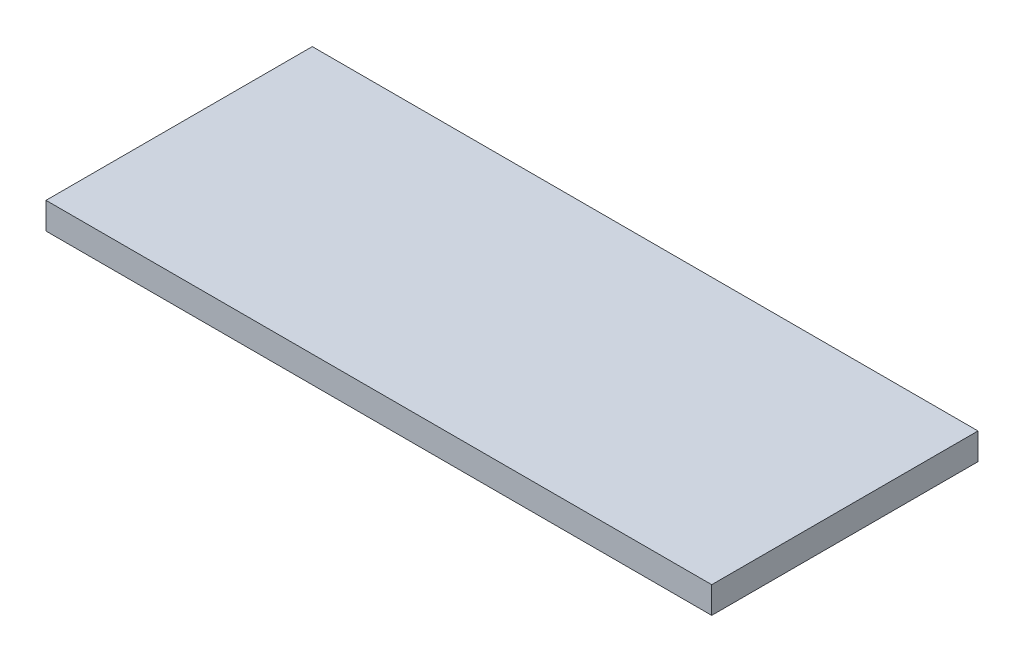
from build123d import *

# Parameters (mm, degrees)
SKIZZE1_W               = 2.5
SKIZZE1_H               = 1
LINEAR_AUSTRAGEN1_DEPTH = 0.1


with BuildPart() as part:
    # Skizze1 → Linear austragen1 (new body)
    with BuildSketch(Plane(origin=(0, 0, 0), x_dir=(1, 0, 0), z_dir=(0, 1, 0))):
        with Locations((-15.263287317, -6.008886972)):
            Rectangle(SKIZZE1_W, SKIZZE1_H)
    extrude(amount=LINEAR_AUSTRAGEN1_DEPTH)


solid = part.part
